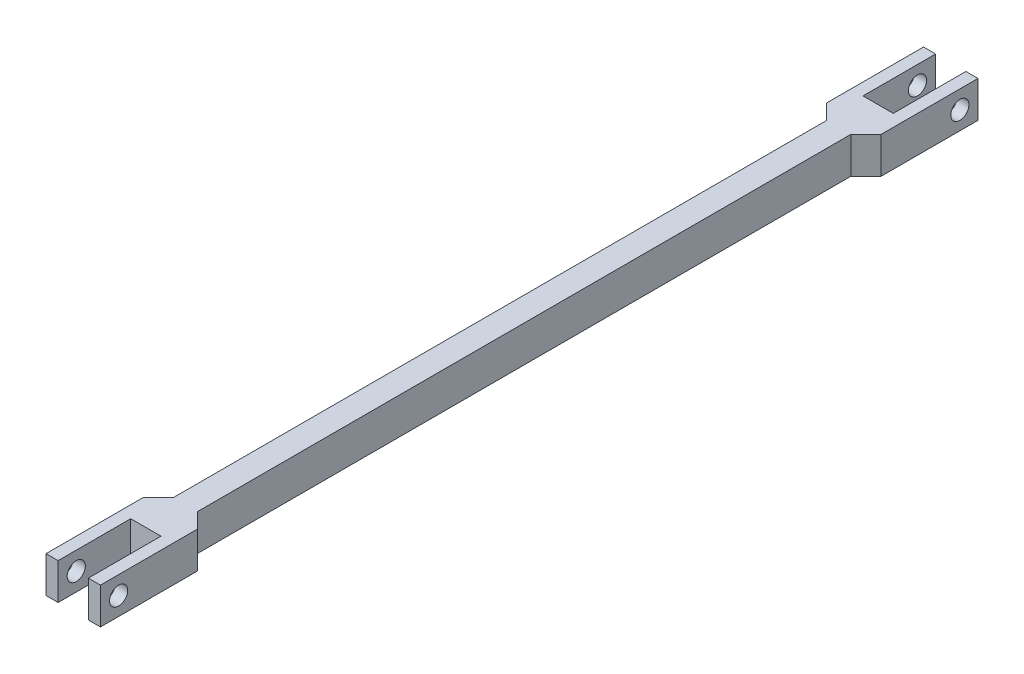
from build123d import *

# Parameters (mm, degrees)
BOSS_EXTRU_1_DEPTH      = 6
ESQUISSE2_R             = 1.5
ENL_V_MAT_EXTRU_1_DEPTH = 146.402888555


with BuildPart() as part:
    # Esquisse1 → Boss.-Extru.1 (new body)
    with BuildSketch(Plane(origin=(0, 0, 0), x_dir=(1, 0, 0), z_dir=(0, 1, 0))):
        Polygon((-2.5, 18.5), (-2.5, 126.5), (0, 129), (0, 145), (-2, 145), (-2, 133), (-7, 133), (-7, 145), (-9, 145), (-9, 129), (-6.5, 126.5), (-6.5, 18.5), (-9, 16), (-9, 0), (-7, 0), (-7, 12), (-2, 12), (-2, 0), (0, 0), (0, 16), align=None)
    extrude(amount=BOSS_EXTRU_1_DEPTH)

    # Esquisse2 → Enl_v. mat.-Extru.1 (cut, through all)
    with BuildSketch(Plane.ZY.offset(9)):
        with Locations((-142, 3)):
            Circle(ESQUISSE2_R)
        with Locations((-3, 3)):
            Circle(ESQUISSE2_R)
    extrude(amount=-ENL_V_MAT_EXTRU_1_DEPTH, mode=Mode.SUBTRACT)


solid = part.part
